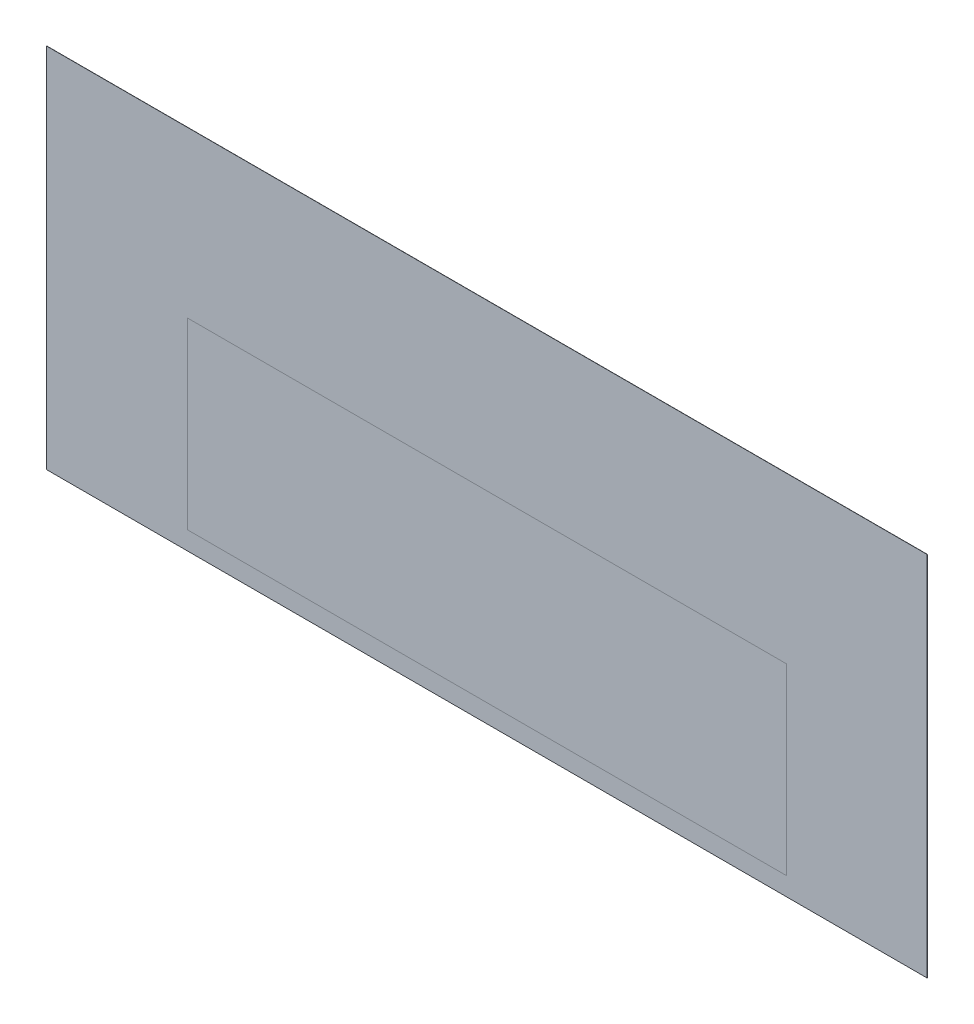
ISO-10303-21;
HEADER;
FILE_DESCRIPTION(('STEP AP214'),'2;1');
FILE_NAME('part.step','',(''),(''),'','','');
FILE_SCHEMA(('AUTOMOTIVE_DESIGN { 1 0 10303 214 1 1 1 1 }'));
ENDSEC;
DATA;
#1=APPLICATION_CONTEXT('core data for automotive mechanical design processes');
#2=APPLICATION_PROTOCOL_DEFINITION('international standard','automotive_design',2000,#1);
#3=PRODUCT_CONTEXT('',#1,'mechanical');
#4=PRODUCT('Part','Part','',(#3));
#5=PRODUCT_RELATED_PRODUCT_CATEGORY('part','',(#4));
#6=PRODUCT_DEFINITION_FORMATION('','',#4);
#7=PRODUCT_DEFINITION_CONTEXT('part definition',#1,'design');
#8=PRODUCT_DEFINITION('design','',#6,#7);
#9=PRODUCT_DEFINITION_SHAPE('','',#8);
#10=(LENGTH_UNIT() NAMED_UNIT(*) SI_UNIT(.MILLI.,.METRE.));
#11=(NAMED_UNIT(*) PLANE_ANGLE_UNIT() SI_UNIT($,.RADIAN.));
#12=(NAMED_UNIT(*) SI_UNIT($,.STERADIAN.) SOLID_ANGLE_UNIT());
#13=UNCERTAINTY_MEASURE_WITH_UNIT(LENGTH_MEASURE(1.E-05),#10,'distance_accuracy_value','');
#14=(GEOMETRIC_REPRESENTATION_CONTEXT(3) GLOBAL_UNCERTAINTY_ASSIGNED_CONTEXT((#13)) GLOBAL_UNIT_ASSIGNED_CONTEXT((#10,
#11,#12)) REPRESENTATION_CONTEXT('',''));
#15=CARTESIAN_POINT('',(0.,0.,0.));
#16=DIRECTION('',(0.,0.,1.));
#17=DIRECTION('',(1.,0.,0.));
#18=AXIS2_PLACEMENT_3D('',#15,#16,#17);
#19=CARTESIAN_POINT('',(0.,0.,0.));
#20=DIRECTION('',(0.,0.,1.));
#21=DIRECTION('',(1.,0.,0.));
#22=AXIS2_PLACEMENT_3D('',#19,#20,#21);
#23=PLANE('',#22);
#24=DIRECTION('',(-1.,0.,0.));
#25=VECTOR('',#24,1.);
#26=CARTESIAN_POINT('',(-3657.6,1524.,0.));
#27=LINE('',#26,#25);
#28=CARTESIAN_POINT('',(3657.6,1524.,0.));
#29=VERTEX_POINT('',#28);
#30=CARTESIAN_POINT('',(-3657.6,1524.,0.));
#31=VERTEX_POINT('',#30);
#32=EDGE_CURVE('E147',#29,#31,#27,.T.);
#33=ORIENTED_EDGE('',*,*,#32,.F.);
#34=DIRECTION('',(0.,1.,0.));
#35=VECTOR('',#34,1.);
#36=CARTESIAN_POINT('',(3657.6,-1524.,0.));
#37=LINE('',#36,#35);
#38=CARTESIAN_POINT('',(3657.6,-1524.,0.));
#39=VERTEX_POINT('',#38);
#40=EDGE_CURVE('E144',#39,#29,#37,.T.);
#41=ORIENTED_EDGE('',*,*,#40,.F.);
#42=DIRECTION('',(1.,0.,0.));
#43=VECTOR('',#42,1.);
#44=CARTESIAN_POINT('',(-3657.6,-1524.,0.));
#45=LINE('',#44,#43);
#46=CARTESIAN_POINT('',(-3657.6,-1524.,0.));
#47=VERTEX_POINT('',#46);
#48=EDGE_CURVE('E289',#47,#39,#45,.T.);
#49=ORIENTED_EDGE('',*,*,#48,.F.);
#50=DIRECTION('',(0.,-1.,0.));
#51=VECTOR('',#50,1.);
#52=CARTESIAN_POINT('',(-3657.6,-1524.,0.));
#53=LINE('',#52,#51);
#54=EDGE_CURVE('E293',#31,#47,#53,.T.);
#55=ORIENTED_EDGE('',*,*,#54,.F.);
#56=EDGE_LOOP('',(#33,#41,#49,#55));
#57=FACE_BOUND('',#56,.T.);
#58=DIRECTION('',(-1.,0.,0.));
#59=VECTOR('',#58,1.);
#60=CARTESIAN_POINT('',(0.,-1371.6,0.));
#61=LINE('',#60,#59);
#62=CARTESIAN_POINT('',(2489.2,-1371.6,0.));
#63=VERTEX_POINT('',#62);
#64=CARTESIAN_POINT('',(-2489.2,-1371.6,0.));
#65=VERTEX_POINT('',#64);
#66=EDGE_CURVE('E11',#63,#65,#61,.T.);
#67=ORIENTED_EDGE('',*,*,#66,.F.);
#68=DIRECTION('',(0.,-1.,0.));
#69=VECTOR('',#68,1.);
#70=CARTESIAN_POINT('',(2489.2,0.,0.));
#71=LINE('',#70,#69);
#72=CARTESIAN_POINT('',(2489.2,152.400000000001,0.));
#73=VERTEX_POINT('',#72);
#74=EDGE_CURVE('E68',#73,#63,#71,.T.);
#75=ORIENTED_EDGE('',*,*,#74,.F.);
#76=DIRECTION('',(1.,0.,0.));
#77=VECTOR('',#76,1.);
#78=CARTESIAN_POINT('',(0.,152.4,0.));
#79=LINE('',#78,#77);
#80=CARTESIAN_POINT('',(-2489.2,152.4,0.));
#81=VERTEX_POINT('',#80);
#82=EDGE_CURVE('E173',#81,#73,#79,.T.);
#83=ORIENTED_EDGE('',*,*,#82,.F.);
#84=DIRECTION('',(0.,1.,0.));
#85=VECTOR('',#84,1.);
#86=CARTESIAN_POINT('',(-2489.2,-1.45069141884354E-12,0.));
#87=LINE('',#86,#85);
#88=EDGE_CURVE('E62',#65,#81,#87,.T.);
#89=ORIENTED_EDGE('',*,*,#88,.F.);
#90=EDGE_LOOP('',(#67,#75,#83,#89));
#91=FACE_BOUND('',#90,.T.);
#92=ADVANCED_FACE('F58',(#57,#91),#23,.F.);
#93=CARTESIAN_POINT('',(0.,0.,1.5875));
#94=DIRECTION('',(0.,0.,1.));
#95=DIRECTION('',(1.,0.,0.));
#96=AXIS2_PLACEMENT_3D('',#93,#94,#95);
#97=PLANE('',#96);
#98=DIRECTION('',(-1.,0.,0.));
#99=VECTOR('',#98,1.);
#100=CARTESIAN_POINT('',(-3657.6,1524.,1.5875));
#101=LINE('',#100,#99);
#102=CARTESIAN_POINT('',(3657.6,1524.,1.5875));
#103=VERTEX_POINT('',#102);
#104=CARTESIAN_POINT('',(-3657.6,1524.,1.5875));
#105=VERTEX_POINT('',#104);
#106=EDGE_CURVE('E133',#103,#105,#101,.T.);
#107=ORIENTED_EDGE('',*,*,#106,.T.);
#108=DIRECTION('',(0.,-1.,0.));
#109=VECTOR('',#108,1.);
#110=CARTESIAN_POINT('',(-3657.6,-1524.,1.5875));
#111=LINE('',#110,#109);
#112=CARTESIAN_POINT('',(-3657.6,-1524.,1.5875));
#113=VERTEX_POINT('',#112);
#114=EDGE_CURVE('E121',#105,#113,#111,.T.);
#115=ORIENTED_EDGE('',*,*,#114,.T.);
#116=DIRECTION('',(1.,0.,0.));
#117=VECTOR('',#116,1.);
#118=CARTESIAN_POINT('',(-3657.6,-1524.,1.5875));
#119=LINE('',#118,#117);
#120=CARTESIAN_POINT('',(3657.6,-1524.,1.5875));
#121=VERTEX_POINT('',#120);
#122=EDGE_CURVE('E132',#113,#121,#119,.T.);
#123=ORIENTED_EDGE('',*,*,#122,.T.);
#124=DIRECTION('',(0.,1.,0.));
#125=VECTOR('',#124,1.);
#126=CARTESIAN_POINT('',(3657.6,-1524.,1.5875));
#127=LINE('',#126,#125);
#128=EDGE_CURVE('E139',#121,#103,#127,.T.);
#129=ORIENTED_EDGE('',*,*,#128,.T.);
#130=EDGE_LOOP('',(#107,#115,#123,#129));
#131=FACE_BOUND('',#130,.T.);
#132=DIRECTION('',(0.,-1.,0.));
#133=VECTOR('',#132,1.);
#134=CARTESIAN_POINT('',(2489.2,0.,1.5875));
#135=LINE('',#134,#133);
#136=CARTESIAN_POINT('',(2489.2,152.400000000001,1.5875));
#137=VERTEX_POINT('',#136);
#138=CARTESIAN_POINT('',(2489.2,-1371.6,1.5875));
#139=VERTEX_POINT('',#138);
#140=EDGE_CURVE('E165',#137,#139,#135,.T.);
#141=ORIENTED_EDGE('',*,*,#140,.T.);
#142=DIRECTION('',(-1.,0.,0.));
#143=VECTOR('',#142,1.);
#144=CARTESIAN_POINT('',(0.,-1371.6,1.5875));
#145=LINE('',#144,#143);
#146=CARTESIAN_POINT('',(-2489.2,-1371.6,1.5875));
#147=VERTEX_POINT('',#146);
#148=EDGE_CURVE('E169',#139,#147,#145,.T.);
#149=ORIENTED_EDGE('',*,*,#148,.T.);
#150=DIRECTION('',(0.,1.,0.));
#151=VECTOR('',#150,1.);
#152=CARTESIAN_POINT('',(-2489.2,-1.45069141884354E-12,1.5875));
#153=LINE('',#152,#151);
#154=CARTESIAN_POINT('',(-2489.2,152.4,1.5875));
#155=VERTEX_POINT('',#154);
#156=EDGE_CURVE('E149',#147,#155,#153,.T.);
#157=ORIENTED_EDGE('',*,*,#156,.T.);
#158=DIRECTION('',(1.,0.,0.));
#159=VECTOR('',#158,1.);
#160=CARTESIAN_POINT('',(0.,152.4,1.5875));
#161=LINE('',#160,#159);
#162=EDGE_CURVE('E156',#155,#137,#161,.T.);
#163=ORIENTED_EDGE('',*,*,#162,.T.);
#164=EDGE_LOOP('',(#141,#149,#157,#163));
#165=FACE_BOUND('',#164,.T.);
#166=ADVANCED_FACE('F136',(#131,#165),#97,.T.);
#167=CARTESIAN_POINT('',(-3657.6,1524.,1.5875));
#168=DIRECTION('',(0.,-1.,0.));
#169=DIRECTION('',(1.,0.,0.));
#170=AXIS2_PLACEMENT_3D('',#167,#168,#169);
#171=PLANE('',#170);
#172=ORIENTED_EDGE('',*,*,#32,.T.);
#173=DIRECTION('',(0.,0.,-1.));
#174=VECTOR('',#173,1.);
#175=CARTESIAN_POINT('',(-3657.6,1524.,1.5875));
#176=LINE('',#175,#174);
#177=EDGE_CURVE('E125',#105,#31,#176,.T.);
#178=ORIENTED_EDGE('',*,*,#177,.F.);
#179=ORIENTED_EDGE('',*,*,#106,.F.);
#180=DIRECTION('',(0.,0.,-1.));
#181=VECTOR('',#180,1.);
#182=CARTESIAN_POINT('',(3657.6,1524.,1.5875));
#183=LINE('',#182,#181);
#184=EDGE_CURVE('E285',#103,#29,#183,.T.);
#185=ORIENTED_EDGE('',*,*,#184,.T.);
#186=EDGE_LOOP('',(#172,#178,#179,#185));
#187=FACE_BOUND('',#186,.T.);
#188=ADVANCED_FACE('F60',(#187),#171,.F.);
#189=CARTESIAN_POINT('',(-3657.6,-1524.,1.5875));
#190=DIRECTION('',(1.,0.,0.));
#191=DIRECTION('',(0.,0.,-1.));
#192=AXIS2_PLACEMENT_3D('',#189,#190,#191);
#193=PLANE('',#192);
#194=ORIENTED_EDGE('',*,*,#54,.T.);
#195=DIRECTION('',(0.,0.,-1.));
#196=VECTOR('',#195,1.);
#197=CARTESIAN_POINT('',(-3657.6,-1524.,1.5875));
#198=LINE('',#197,#196);
#199=EDGE_CURVE('E128',#113,#47,#198,.T.);
#200=ORIENTED_EDGE('',*,*,#199,.F.);
#201=ORIENTED_EDGE('',*,*,#114,.F.);
#202=ORIENTED_EDGE('',*,*,#177,.T.);
#203=EDGE_LOOP('',(#194,#200,#201,#202));
#204=FACE_BOUND('',#203,.T.);
#205=ADVANCED_FACE('F123',(#204),#193,.F.);
#206=CARTESIAN_POINT('',(-3657.6,-1524.,1.5875));
#207=DIRECTION('',(0.,1.,0.));
#208=DIRECTION('',(-1.,0.,0.));
#209=AXIS2_PLACEMENT_3D('',#206,#207,#208);
#210=PLANE('',#209);
#211=ORIENTED_EDGE('',*,*,#48,.T.);
#212=DIRECTION('',(0.,0.,-1.));
#213=VECTOR('',#212,1.);
#214=CARTESIAN_POINT('',(3657.6,-1524.,1.5875));
#215=LINE('',#214,#213);
#216=EDGE_CURVE('E158',#121,#39,#215,.T.);
#217=ORIENTED_EDGE('',*,*,#216,.F.);
#218=ORIENTED_EDGE('',*,*,#122,.F.);
#219=ORIENTED_EDGE('',*,*,#199,.T.);
#220=EDGE_LOOP('',(#211,#217,#218,#219));
#221=FACE_BOUND('',#220,.T.);
#222=ADVANCED_FACE('F202',(#221),#210,.F.);
#223=CARTESIAN_POINT('',(3657.6,-1524.,1.5875));
#224=DIRECTION('',(-1.,0.,0.));
#225=DIRECTION('',(0.,0.,1.));
#226=AXIS2_PLACEMENT_3D('',#223,#224,#225);
#227=PLANE('',#226);
#228=ORIENTED_EDGE('',*,*,#40,.T.);
#229=ORIENTED_EDGE('',*,*,#184,.F.);
#230=ORIENTED_EDGE('',*,*,#128,.F.);
#231=ORIENTED_EDGE('',*,*,#216,.T.);
#232=EDGE_LOOP('',(#228,#229,#230,#231));
#233=FACE_BOUND('',#232,.T.);
#234=ADVANCED_FACE('F197',(#233),#227,.F.);
#235=ORIENTED_EDGE('',*,*,#148,.F.);
#236=ORIENTED_EDGE('',*,*,#140,.F.);
#237=ORIENTED_EDGE('',*,*,#162,.F.);
#238=ORIENTED_EDGE('',*,*,#156,.F.);
#239=EDGE_LOOP('',(#235,#236,#237,#238));
#240=FACE_BOUND('',#239,.T.);
#241=ADVANCED_FACE('F192',(#240),#97,.T.);
#242=ORIENTED_EDGE('',*,*,#74,.T.);
#243=ORIENTED_EDGE('',*,*,#66,.T.);
#244=ORIENTED_EDGE('',*,*,#88,.T.);
#245=ORIENTED_EDGE('',*,*,#82,.T.);
#246=EDGE_LOOP('',(#242,#243,#244,#245));
#247=FACE_BOUND('',#246,.T.);
#248=ADVANCED_FACE('F182',(#247),#23,.F.);
#249=CLOSED_SHELL('',(#92,#166,#188,#205,#222,#234,#241,#248));
#250=MANIFOLD_SOLID_BREP('B2',#249);
#251=ADVANCED_BREP_SHAPE_REPRESENTATION('',(#18,#250),#14);
#252=SHAPE_DEFINITION_REPRESENTATION(#9,#251);
ENDSEC;
END-ISO-10303-21;
